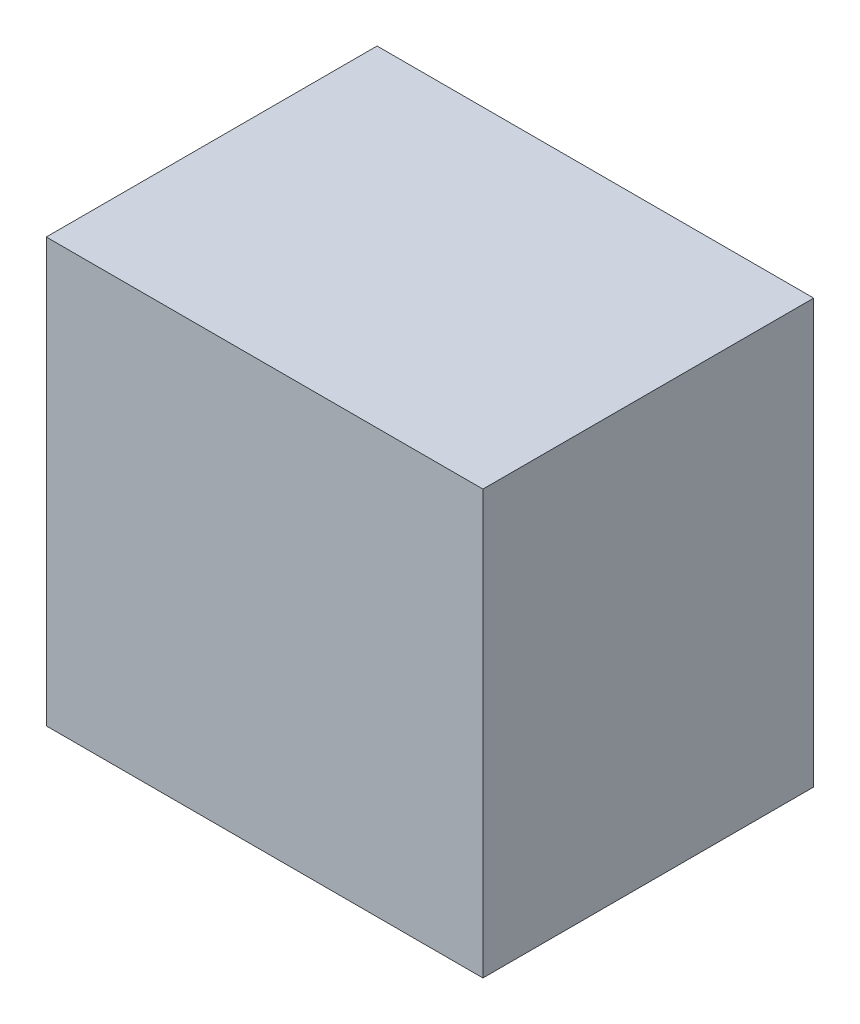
ISO-10303-21;
HEADER;
FILE_DESCRIPTION(('STEP AP214'),'2;1');
FILE_NAME('part.step','',(''),(''),'','','');
FILE_SCHEMA(('AUTOMOTIVE_DESIGN { 1 0 10303 214 1 1 1 1 }'));
ENDSEC;
DATA;
#1=APPLICATION_CONTEXT('core data for automotive mechanical design processes');
#2=APPLICATION_PROTOCOL_DEFINITION('international standard','automotive_design',2000,#1);
#3=PRODUCT_CONTEXT('',#1,'mechanical');
#4=PRODUCT('Part','Part','',(#3));
#5=PRODUCT_RELATED_PRODUCT_CATEGORY('part','',(#4));
#6=PRODUCT_DEFINITION_FORMATION('','',#4);
#7=PRODUCT_DEFINITION_CONTEXT('part definition',#1,'design');
#8=PRODUCT_DEFINITION('design','',#6,#7);
#9=PRODUCT_DEFINITION_SHAPE('','',#8);
#10=(LENGTH_UNIT() NAMED_UNIT(*) SI_UNIT(.MILLI.,.METRE.));
#11=(NAMED_UNIT(*) PLANE_ANGLE_UNIT() SI_UNIT($,.RADIAN.));
#12=(NAMED_UNIT(*) SI_UNIT($,.STERADIAN.) SOLID_ANGLE_UNIT());
#13=UNCERTAINTY_MEASURE_WITH_UNIT(LENGTH_MEASURE(1.E-05),#10,'distance_accuracy_value','');
#14=(GEOMETRIC_REPRESENTATION_CONTEXT(3) GLOBAL_UNCERTAINTY_ASSIGNED_CONTEXT((#13)) GLOBAL_UNIT_ASSIGNED_CONTEXT((#10,
#11,#12)) REPRESENTATION_CONTEXT('',''));
#15=CARTESIAN_POINT('',(0.,0.,0.));
#16=DIRECTION('',(0.,0.,1.));
#17=DIRECTION('',(1.,0.,0.));
#18=AXIS2_PLACEMENT_3D('',#15,#16,#17);
#19=CARTESIAN_POINT('',(-3.30000129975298,1.19999973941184,0.));
#20=DIRECTION('',(-8.74227765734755E-08,0.999999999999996,0.));
#21=DIRECTION('',(0.999999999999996,8.74227765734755E-08,0.));
#22=AXIS2_PLACEMENT_3D('',#19,#20,#21);
#23=PLANE('',#22);
#24=DIRECTION('',(0.,0.,1.));
#25=VECTOR('',#24,1.);
#26=CARTESIAN_POINT('',(-3.30000129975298,1.19999973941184,0.));
#27=LINE('',#26,#25);
#28=CARTESIAN_POINT('',(-3.30000129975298,1.19999973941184,0.));
#29=VERTEX_POINT('',#28);
#30=CARTESIAN_POINT('',(-3.30000129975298,1.19999973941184,5.00000016));
#31=VERTEX_POINT('',#30);
#32=EDGE_CURVE('E11',#29,#31,#27,.T.);
#33=ORIENTED_EDGE('',*,*,#32,.T.);
#34=DIRECTION('',(0.999999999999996,8.74227765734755E-08,0.));
#35=VECTOR('',#34,1.);
#36=CARTESIAN_POINT('',(-3.30000129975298,1.19999973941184,5.00000016));
#37=LINE('',#36,#35);
#38=CARTESIAN_POINT('',(3.300000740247,1.20000031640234,5.00000016));
#39=VERTEX_POINT('',#38);
#40=EDGE_CURVE('E24',#31,#39,#37,.T.);
#41=ORIENTED_EDGE('',*,*,#40,.T.);
#42=DIRECTION('',(0.,0.,1.));
#43=VECTOR('',#42,1.);
#44=CARTESIAN_POINT('',(3.300000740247,1.20000031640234,0.));
#45=LINE('',#44,#43);
#46=CARTESIAN_POINT('',(3.300000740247,1.20000031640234,0.));
#47=VERTEX_POINT('',#46);
#48=EDGE_CURVE('E84',#47,#39,#45,.T.);
#49=ORIENTED_EDGE('',*,*,#48,.F.);
#50=DIRECTION('',(0.999999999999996,8.74227765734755E-08,0.));
#51=VECTOR('',#50,1.);
#52=CARTESIAN_POINT('',(-3.30000129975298,1.19999973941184,0.));
#53=LINE('',#52,#51);
#54=EDGE_CURVE('E82',#29,#47,#53,.T.);
#55=ORIENTED_EDGE('',*,*,#54,.F.);
#56=EDGE_LOOP('',(#33,#41,#49,#55));
#57=FACE_BOUND('',#56,.T.);
#58=ADVANCED_FACE('F17',(#57),#23,.T.);
#59=CARTESIAN_POINT('',(3.300000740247,1.20000031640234,0.));
#60=DIRECTION('',(0.999999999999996,8.74227765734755E-08,0.));
#61=DIRECTION('',(8.74227765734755E-08,-0.999999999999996,0.));
#62=AXIS2_PLACEMENT_3D('',#59,#60,#61);
#63=PLANE('',#62);
#64=ORIENTED_EDGE('',*,*,#48,.T.);
#65=DIRECTION('',(8.74227765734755E-08,-0.999999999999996,0.));
#66=VECTOR('',#65,1.);
#67=CARTESIAN_POINT('',(3.300000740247,1.20000031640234,5.00000016));
#68=LINE('',#67,#66);
#69=CARTESIAN_POINT('',(3.30000129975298,-5.20000212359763,5.00000016));
#70=VERTEX_POINT('',#69);
#71=EDGE_CURVE('E79',#39,#70,#68,.T.);
#72=ORIENTED_EDGE('',*,*,#71,.T.);
#73=DIRECTION('',(0.,0.,1.));
#74=VECTOR('',#73,1.);
#75=CARTESIAN_POINT('',(3.30000129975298,-5.20000212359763,0.));
#76=LINE('',#75,#74);
#77=CARTESIAN_POINT('',(3.30000129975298,-5.20000212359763,0.));
#78=VERTEX_POINT('',#77);
#79=EDGE_CURVE('E77',#78,#70,#76,.T.);
#80=ORIENTED_EDGE('',*,*,#79,.F.);
#81=DIRECTION('',(8.74227765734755E-08,-0.999999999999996,0.));
#82=VECTOR('',#81,1.);
#83=CARTESIAN_POINT('',(3.300000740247,1.20000031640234,0.));
#84=LINE('',#83,#82);
#85=EDGE_CURVE('E67',#47,#78,#84,.T.);
#86=ORIENTED_EDGE('',*,*,#85,.F.);
#87=EDGE_LOOP('',(#64,#72,#80,#86));
#88=FACE_BOUND('',#87,.T.);
#89=ADVANCED_FACE('F90',(#88),#63,.T.);
#90=CARTESIAN_POINT('',(3.30000129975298,-5.20000212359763,0.));
#91=DIRECTION('',(8.74227765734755E-08,-0.999999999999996,0.));
#92=DIRECTION('',(-0.999999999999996,-8.74227765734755E-08,0.));
#93=AXIS2_PLACEMENT_3D('',#90,#91,#92);
#94=PLANE('',#93);
#95=ORIENTED_EDGE('',*,*,#79,.T.);
#96=DIRECTION('',(-0.999999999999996,-8.74227765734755E-08,0.));
#97=VECTOR('',#96,1.);
#98=CARTESIAN_POINT('',(3.30000129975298,-5.20000212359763,5.00000016));
#99=LINE('',#98,#97);
#100=CARTESIAN_POINT('',(-3.300000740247,-5.20000270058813,5.00000016));
#101=VERTEX_POINT('',#100);
#102=EDGE_CURVE('E59',#70,#101,#99,.T.);
#103=ORIENTED_EDGE('',*,*,#102,.T.);
#104=DIRECTION('',(0.,0.,1.));
#105=VECTOR('',#104,1.);
#106=CARTESIAN_POINT('',(-3.300000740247,-5.20000270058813,0.));
#107=LINE('',#106,#105);
#108=CARTESIAN_POINT('',(-3.300000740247,-5.20000270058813,0.));
#109=VERTEX_POINT('',#108);
#110=EDGE_CURVE('E54',#109,#101,#107,.T.);
#111=ORIENTED_EDGE('',*,*,#110,.F.);
#112=DIRECTION('',(-0.999999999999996,-8.74227765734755E-08,0.));
#113=VECTOR('',#112,1.);
#114=CARTESIAN_POINT('',(3.30000129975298,-5.20000212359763,0.));
#115=LINE('',#114,#113);
#116=EDGE_CURVE('E58',#78,#109,#115,.T.);
#117=ORIENTED_EDGE('',*,*,#116,.F.);
#118=EDGE_LOOP('',(#95,#103,#111,#117));
#119=FACE_BOUND('',#118,.T.);
#120=ADVANCED_FACE('F57',(#119),#94,.T.);
#121=CARTESIAN_POINT('',(-3.300000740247,-5.20000270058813,0.));
#122=DIRECTION('',(-0.999999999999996,-8.74227765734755E-08,0.));
#123=DIRECTION('',(-8.74227765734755E-08,0.999999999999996,0.));
#124=AXIS2_PLACEMENT_3D('',#121,#122,#123);
#125=PLANE('',#124);
#126=ORIENTED_EDGE('',*,*,#110,.T.);
#127=DIRECTION('',(-8.74227765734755E-08,0.999999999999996,0.));
#128=VECTOR('',#127,1.);
#129=CARTESIAN_POINT('',(-3.300000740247,-5.20000270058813,5.00000016));
#130=LINE('',#129,#128);
#131=EDGE_CURVE('E69',#101,#31,#130,.T.);
#132=ORIENTED_EDGE('',*,*,#131,.T.);
#133=ORIENTED_EDGE('',*,*,#32,.F.);
#134=DIRECTION('',(-8.74227765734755E-08,0.999999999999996,0.));
#135=VECTOR('',#134,1.);
#136=CARTESIAN_POINT('',(-3.300000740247,-5.20000270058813,0.));
#137=LINE('',#136,#135);
#138=EDGE_CURVE('E66',#109,#29,#137,.T.);
#139=ORIENTED_EDGE('',*,*,#138,.F.);
#140=EDGE_LOOP('',(#126,#132,#133,#139));
#141=FACE_BOUND('',#140,.T.);
#142=ADVANCED_FACE('F71',(#141),#125,.T.);
#143=CARTESIAN_POINT('',(-3.30000129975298,1.19999973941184,0.));
#144=DIRECTION('',(0.,0.,1.));
#145=DIRECTION('',(-0.999999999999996,-8.74227765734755E-08,0.));
#146=AXIS2_PLACEMENT_3D('',#143,#144,#145);
#147=PLANE('',#146);
#148=ORIENTED_EDGE('',*,*,#54,.T.);
#149=ORIENTED_EDGE('',*,*,#85,.T.);
#150=ORIENTED_EDGE('',*,*,#116,.T.);
#151=ORIENTED_EDGE('',*,*,#138,.T.);
#152=EDGE_LOOP('',(#148,#149,#150,#151));
#153=FACE_BOUND('',#152,.T.);
#154=ADVANCED_FACE('F65',(#153),#147,.F.);
#155=CARTESIAN_POINT('',(-3.30000129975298,1.19999973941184,5.00000016));
#156=DIRECTION('',(0.,0.,1.));
#157=DIRECTION('',(-0.999999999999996,-8.74227765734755E-08,0.));
#158=AXIS2_PLACEMENT_3D('',#155,#156,#157);
#159=PLANE('',#158);
#160=ORIENTED_EDGE('',*,*,#131,.F.);
#161=ORIENTED_EDGE('',*,*,#102,.F.);
#162=ORIENTED_EDGE('',*,*,#71,.F.);
#163=ORIENTED_EDGE('',*,*,#40,.F.);
#164=EDGE_LOOP('',(#160,#161,#162,#163));
#165=FACE_BOUND('',#164,.T.);
#166=ADVANCED_FACE('F91',(#165),#159,.T.);
#167=CLOSED_SHELL('',(#58,#89,#120,#142,#154,#166));
#168=MANIFOLD_SOLID_BREP('B1',#167);
#169=ADVANCED_BREP_SHAPE_REPRESENTATION('',(#18,#168),#14);
#170=SHAPE_DEFINITION_REPRESENTATION(#9,#169);
ENDSEC;
END-ISO-10303-21;
